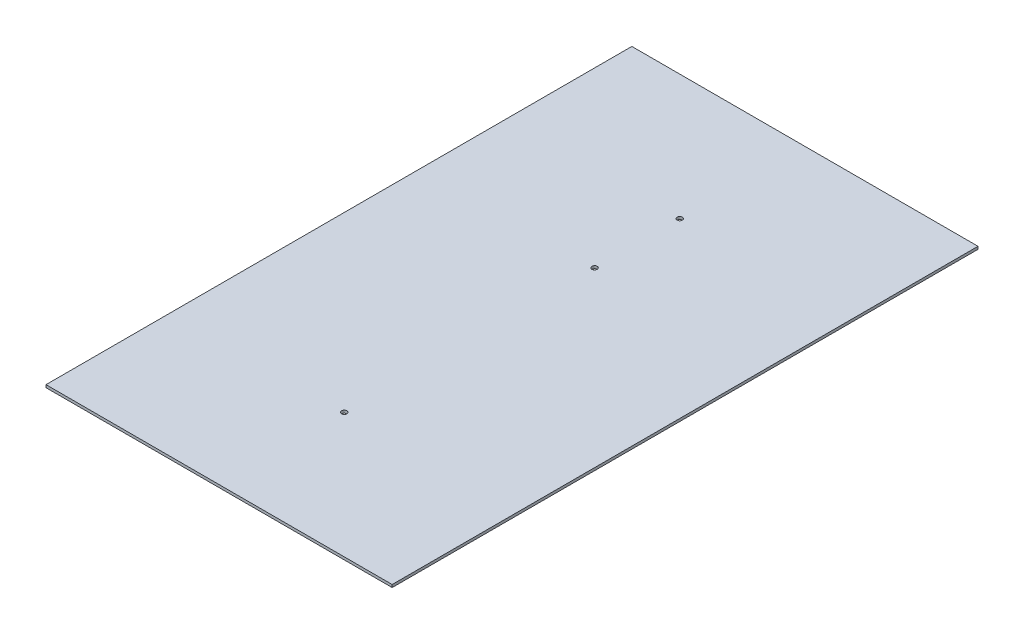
ISO-10303-21;
HEADER;
FILE_DESCRIPTION(('STEP AP214'),'2;1');
FILE_NAME('part.step','',(''),(''),'','','');
FILE_SCHEMA(('AUTOMOTIVE_DESIGN { 1 0 10303 214 1 1 1 1 }'));
ENDSEC;
DATA;
#1=APPLICATION_CONTEXT('core data for automotive mechanical design processes');
#2=APPLICATION_PROTOCOL_DEFINITION('international standard','automotive_design',2000,#1);
#3=PRODUCT_CONTEXT('',#1,'mechanical');
#4=PRODUCT('Part','Part','',(#3));
#5=PRODUCT_RELATED_PRODUCT_CATEGORY('part','',(#4));
#6=PRODUCT_DEFINITION_FORMATION('','',#4);
#7=PRODUCT_DEFINITION_CONTEXT('part definition',#1,'design');
#8=PRODUCT_DEFINITION('design','',#6,#7);
#9=PRODUCT_DEFINITION_SHAPE('','',#8);
#10=(LENGTH_UNIT() NAMED_UNIT(*) SI_UNIT(.MILLI.,.METRE.));
#11=(NAMED_UNIT(*) PLANE_ANGLE_UNIT() SI_UNIT($,.RADIAN.));
#12=(NAMED_UNIT(*) SI_UNIT($,.STERADIAN.) SOLID_ANGLE_UNIT());
#13=UNCERTAINTY_MEASURE_WITH_UNIT(LENGTH_MEASURE(1.E-05),#10,'distance_accuracy_value','');
#14=(GEOMETRIC_REPRESENTATION_CONTEXT(3) GLOBAL_UNCERTAINTY_ASSIGNED_CONTEXT((#13)) GLOBAL_UNIT_ASSIGNED_CONTEXT((#10,
#11,#12)) REPRESENTATION_CONTEXT('',''));
#15=CARTESIAN_POINT('',(0.,0.,0.));
#16=DIRECTION('',(0.,0.,1.));
#17=DIRECTION('',(1.,0.,0.));
#18=AXIS2_PLACEMENT_3D('',#15,#16,#17);
#19=CARTESIAN_POINT('',(0.,1.,0.));
#20=DIRECTION('',(0.,1.,0.));
#21=DIRECTION('',(0.,0.,1.));
#22=AXIS2_PLACEMENT_3D('',#19,#20,#21);
#23=PLANE('',#22);
#24=CARTESIAN_POINT('',(0.,1.,-31.));
#25=DIRECTION('',(0.,1.,0.));
#26=DIRECTION('',(0.,0.,1.));
#27=AXIS2_PLACEMENT_3D('',#24,#25,#26);
#28=CIRCLE('',#27,1.);
#29=CARTESIAN_POINT('',(0.,1.,-30.));
#30=VERTEX_POINT('',#29);
#31=EDGE_CURVE('E115',#30,#30,#28,.T.);
#32=ORIENTED_EDGE('',*,*,#31,.F.);
#33=EDGE_LOOP('',(#32));
#34=FACE_BOUND('',#33,.T.);
#35=DIRECTION('',(0.,0.,-1.));
#36=VECTOR('',#35,1.);
#37=CARTESIAN_POINT('',(65.,1.,-110.));
#38=LINE('',#37,#36);
#39=CARTESIAN_POINT('',(65.,1.,110.));
#40=VERTEX_POINT('',#39);
#41=CARTESIAN_POINT('',(65.,1.,-110.));
#42=VERTEX_POINT('',#41);
#43=EDGE_CURVE('E85',#40,#42,#38,.T.);
#44=ORIENTED_EDGE('',*,*,#43,.T.);
#45=DIRECTION('',(-1.,0.,0.));
#46=VECTOR('',#45,1.);
#47=CARTESIAN_POINT('',(-65.,1.,-110.));
#48=LINE('',#47,#46);
#49=CARTESIAN_POINT('',(-65.,1.,-110.));
#50=VERTEX_POINT('',#49);
#51=EDGE_CURVE('E80',#42,#50,#48,.T.);
#52=ORIENTED_EDGE('',*,*,#51,.T.);
#53=DIRECTION('',(0.,0.,1.));
#54=VECTOR('',#53,1.);
#55=CARTESIAN_POINT('',(-65.,1.,-110.));
#56=LINE('',#55,#54);
#57=CARTESIAN_POINT('',(-65.,1.,110.));
#58=VERTEX_POINT('',#57);
#59=EDGE_CURVE('E83',#50,#58,#56,.T.);
#60=ORIENTED_EDGE('',*,*,#59,.T.);
#61=DIRECTION('',(1.,0.,0.));
#62=VECTOR('',#61,1.);
#63=CARTESIAN_POINT('',(-65.,1.,110.));
#64=LINE('',#63,#62);
#65=EDGE_CURVE('E50',#58,#40,#64,.T.);
#66=ORIENTED_EDGE('',*,*,#65,.T.);
#67=EDGE_LOOP('',(#44,#52,#60,#66));
#68=FACE_BOUND('',#67,.T.);
#69=CARTESIAN_POINT('',(0.,1.,-63.));
#70=DIRECTION('',(0.,1.,0.));
#71=DIRECTION('',(0.,0.,1.));
#72=AXIS2_PLACEMENT_3D('',#69,#70,#71);
#73=CIRCLE('',#72,1.);
#74=CARTESIAN_POINT('',(0.,1.,-62.));
#75=VERTEX_POINT('',#74);
#76=EDGE_CURVE('E100',#75,#75,#73,.T.);
#77=ORIENTED_EDGE('',*,*,#76,.F.);
#78=EDGE_LOOP('',(#77));
#79=FACE_BOUND('',#78,.T.);
#80=CARTESIAN_POINT('',(0.,1.,63.));
#81=DIRECTION('',(0.,1.,0.));
#82=DIRECTION('',(0.,0.,1.));
#83=AXIS2_PLACEMENT_3D('',#80,#81,#82);
#84=CIRCLE('',#83,1.);
#85=CARTESIAN_POINT('',(0.,1.,64.));
#86=VERTEX_POINT('',#85);
#87=EDGE_CURVE('E121',#86,#86,#84,.T.);
#88=ORIENTED_EDGE('',*,*,#87,.F.);
#89=EDGE_LOOP('',(#88));
#90=FACE_BOUND('',#89,.T.);
#91=ADVANCED_FACE('F33',(#34,#68,#79,#90),#23,.T.);
#92=CARTESIAN_POINT('',(0.,0.,0.));
#93=DIRECTION('',(0.,1.,0.));
#94=DIRECTION('',(0.,0.,1.));
#95=AXIS2_PLACEMENT_3D('',#92,#93,#94);
#96=PLANE('',#95);
#97=DIRECTION('',(0.,0.,-1.));
#98=VECTOR('',#97,1.);
#99=CARTESIAN_POINT('',(65.,0.,-110.));
#100=LINE('',#99,#98);
#101=CARTESIAN_POINT('',(65.,0.,110.));
#102=VERTEX_POINT('',#101);
#103=CARTESIAN_POINT('',(65.,0.,-110.));
#104=VERTEX_POINT('',#103);
#105=EDGE_CURVE('E97',#102,#104,#100,.T.);
#106=ORIENTED_EDGE('',*,*,#105,.F.);
#107=DIRECTION('',(1.,0.,0.));
#108=VECTOR('',#107,1.);
#109=CARTESIAN_POINT('',(-65.,0.,110.));
#110=LINE('',#109,#108);
#111=CARTESIAN_POINT('',(-65.,0.,110.));
#112=VERTEX_POINT('',#111);
#113=EDGE_CURVE('E73',#112,#102,#110,.T.);
#114=ORIENTED_EDGE('',*,*,#113,.F.);
#115=DIRECTION('',(0.,0.,1.));
#116=VECTOR('',#115,1.);
#117=CARTESIAN_POINT('',(-65.,0.,-110.));
#118=LINE('',#117,#116);
#119=CARTESIAN_POINT('',(-65.,0.,-110.));
#120=VERTEX_POINT('',#119);
#121=EDGE_CURVE('E67',#120,#112,#118,.T.);
#122=ORIENTED_EDGE('',*,*,#121,.F.);
#123=DIRECTION('',(-1.,0.,0.));
#124=VECTOR('',#123,1.);
#125=CARTESIAN_POINT('',(-65.,0.,-110.));
#126=LINE('',#125,#124);
#127=EDGE_CURVE('E89',#104,#120,#126,.T.);
#128=ORIENTED_EDGE('',*,*,#127,.F.);
#129=EDGE_LOOP('',(#106,#114,#122,#128));
#130=FACE_BOUND('',#129,.T.);
#131=CARTESIAN_POINT('',(0.,0.,-63.));
#132=DIRECTION('',(0.,1.,0.));
#133=DIRECTION('',(0.,0.,1.));
#134=AXIS2_PLACEMENT_3D('',#131,#132,#133);
#135=CIRCLE('',#134,1.);
#136=CARTESIAN_POINT('',(0.,0.,-62.));
#137=VERTEX_POINT('',#136);
#138=EDGE_CURVE('E112',#137,#137,#135,.T.);
#139=ORIENTED_EDGE('',*,*,#138,.T.);
#140=EDGE_LOOP('',(#139));
#141=FACE_BOUND('',#140,.T.);
#142=CARTESIAN_POINT('',(0.,0.,-31.));
#143=DIRECTION('',(0.,1.,0.));
#144=DIRECTION('',(0.,0.,1.));
#145=AXIS2_PLACEMENT_3D('',#142,#143,#144);
#146=CIRCLE('',#145,1.);
#147=CARTESIAN_POINT('',(0.,0.,-30.));
#148=VERTEX_POINT('',#147);
#149=EDGE_CURVE('E118',#148,#148,#146,.T.);
#150=ORIENTED_EDGE('',*,*,#149,.T.);
#151=EDGE_LOOP('',(#150));
#152=FACE_BOUND('',#151,.T.);
#153=CARTESIAN_POINT('',(0.,0.,63.));
#154=DIRECTION('',(0.,1.,0.));
#155=DIRECTION('',(0.,0.,1.));
#156=AXIS2_PLACEMENT_3D('',#153,#154,#155);
#157=CIRCLE('',#156,1.);
#158=CARTESIAN_POINT('',(0.,0.,64.));
#159=VERTEX_POINT('',#158);
#160=EDGE_CURVE('E124',#159,#159,#157,.T.);
#161=ORIENTED_EDGE('',*,*,#160,.T.);
#162=EDGE_LOOP('',(#161));
#163=FACE_BOUND('',#162,.T.);
#164=ADVANCED_FACE('F108',(#130,#141,#152,#163),#96,.F.);
#165=CARTESIAN_POINT('',(65.,1.,-110.));
#166=DIRECTION('',(-1.,0.,0.));
#167=DIRECTION('',(0.,0.,1.));
#168=AXIS2_PLACEMENT_3D('',#165,#166,#167);
#169=PLANE('',#168);
#170=ORIENTED_EDGE('',*,*,#105,.T.);
#171=DIRECTION('',(0.,-1.,0.));
#172=VECTOR('',#171,1.);
#173=CARTESIAN_POINT('',(65.,1.,-110.));
#174=LINE('',#173,#172);
#175=EDGE_CURVE('E11',#42,#104,#174,.T.);
#176=ORIENTED_EDGE('',*,*,#175,.F.);
#177=ORIENTED_EDGE('',*,*,#43,.F.);
#178=DIRECTION('',(0.,-1.,0.));
#179=VECTOR('',#178,1.);
#180=CARTESIAN_POINT('',(65.,1.,110.));
#181=LINE('',#180,#179);
#182=EDGE_CURVE('E93',#40,#102,#181,.T.);
#183=ORIENTED_EDGE('',*,*,#182,.T.);
#184=EDGE_LOOP('',(#170,#176,#177,#183));
#185=FACE_BOUND('',#184,.T.);
#186=ADVANCED_FACE('F35',(#185),#169,.F.);
#187=CARTESIAN_POINT('',(-65.,1.,-110.));
#188=DIRECTION('',(0.,0.,1.));
#189=DIRECTION('',(1.,0.,0.));
#190=AXIS2_PLACEMENT_3D('',#187,#188,#189);
#191=PLANE('',#190);
#192=ORIENTED_EDGE('',*,*,#127,.T.);
#193=DIRECTION('',(0.,-1.,0.));
#194=VECTOR('',#193,1.);
#195=CARTESIAN_POINT('',(-65.,1.,-110.));
#196=LINE('',#195,#194);
#197=EDGE_CURVE('E42',#50,#120,#196,.T.);
#198=ORIENTED_EDGE('',*,*,#197,.F.);
#199=ORIENTED_EDGE('',*,*,#51,.F.);
#200=ORIENTED_EDGE('',*,*,#175,.T.);
#201=EDGE_LOOP('',(#192,#198,#199,#200));
#202=FACE_BOUND('',#201,.T.);
#203=ADVANCED_FACE('F88',(#202),#191,.F.);
#204=CARTESIAN_POINT('',(-65.,1.,-110.));
#205=DIRECTION('',(1.,0.,0.));
#206=DIRECTION('',(0.,0.,-1.));
#207=AXIS2_PLACEMENT_3D('',#204,#205,#206);
#208=PLANE('',#207);
#209=ORIENTED_EDGE('',*,*,#121,.T.);
#210=DIRECTION('',(0.,-1.,0.));
#211=VECTOR('',#210,1.);
#212=CARTESIAN_POINT('',(-65.,1.,110.));
#213=LINE('',#212,#211);
#214=EDGE_CURVE('E90',#58,#112,#213,.T.);
#215=ORIENTED_EDGE('',*,*,#214,.F.);
#216=ORIENTED_EDGE('',*,*,#59,.F.);
#217=ORIENTED_EDGE('',*,*,#197,.T.);
#218=EDGE_LOOP('',(#209,#215,#216,#217));
#219=FACE_BOUND('',#218,.T.);
#220=ADVANCED_FACE('F91',(#219),#208,.F.);
#221=CARTESIAN_POINT('',(-65.,1.,110.));
#222=DIRECTION('',(0.,0.,-1.));
#223=DIRECTION('',(-1.,0.,0.));
#224=AXIS2_PLACEMENT_3D('',#221,#222,#223);
#225=PLANE('',#224);
#226=ORIENTED_EDGE('',*,*,#113,.T.);
#227=ORIENTED_EDGE('',*,*,#182,.F.);
#228=ORIENTED_EDGE('',*,*,#65,.F.);
#229=ORIENTED_EDGE('',*,*,#214,.T.);
#230=EDGE_LOOP('',(#226,#227,#228,#229));
#231=FACE_BOUND('',#230,.T.);
#232=ADVANCED_FACE('F105',(#231),#225,.F.);
#233=CARTESIAN_POINT('',(0.,1.,-63.));
#234=DIRECTION('',(0.,-1.,0.));
#235=DIRECTION('',(0.,0.,-1.));
#236=AXIS2_PLACEMENT_3D('',#233,#234,#235);
#237=CYLINDRICAL_SURFACE('',#236,1.);
#238=ORIENTED_EDGE('',*,*,#76,.T.);
#239=EDGE_LOOP('',(#238));
#240=FACE_BOUND('',#239,.T.);
#241=ORIENTED_EDGE('',*,*,#138,.F.);
#242=EDGE_LOOP('',(#241));
#243=FACE_BOUND('',#242,.T.);
#244=ADVANCED_FACE('F142',(#240,#243),#237,.F.);
#245=CARTESIAN_POINT('',(0.,1.,-31.));
#246=DIRECTION('',(0.,-1.,0.));
#247=DIRECTION('',(0.,0.,-1.));
#248=AXIS2_PLACEMENT_3D('',#245,#246,#247);
#249=CYLINDRICAL_SURFACE('',#248,1.);
#250=ORIENTED_EDGE('',*,*,#31,.T.);
#251=EDGE_LOOP('',(#250));
#252=FACE_BOUND('',#251,.T.);
#253=ORIENTED_EDGE('',*,*,#149,.F.);
#254=EDGE_LOOP('',(#253));
#255=FACE_BOUND('',#254,.T.);
#256=ADVANCED_FACE('F188',(#252,#255),#249,.F.);
#257=CARTESIAN_POINT('',(0.,1.,63.));
#258=DIRECTION('',(0.,-1.,0.));
#259=DIRECTION('',(0.,0.,-1.));
#260=AXIS2_PLACEMENT_3D('',#257,#258,#259);
#261=CYLINDRICAL_SURFACE('',#260,1.);
#262=ORIENTED_EDGE('',*,*,#87,.T.);
#263=EDGE_LOOP('',(#262));
#264=FACE_BOUND('',#263,.T.);
#265=ORIENTED_EDGE('',*,*,#160,.F.);
#266=EDGE_LOOP('',(#265));
#267=FACE_BOUND('',#266,.T.);
#268=ADVANCED_FACE('F130',(#264,#267),#261,.F.);
#269=CLOSED_SHELL('',(#91,#164,#186,#203,#220,#232,#244,#256,#268));
#270=MANIFOLD_SOLID_BREP('B2',#269);
#271=ADVANCED_BREP_SHAPE_REPRESENTATION('',(#18,#270),#14);
#272=SHAPE_DEFINITION_REPRESENTATION(#9,#271);
ENDSEC;
END-ISO-10303-21;
